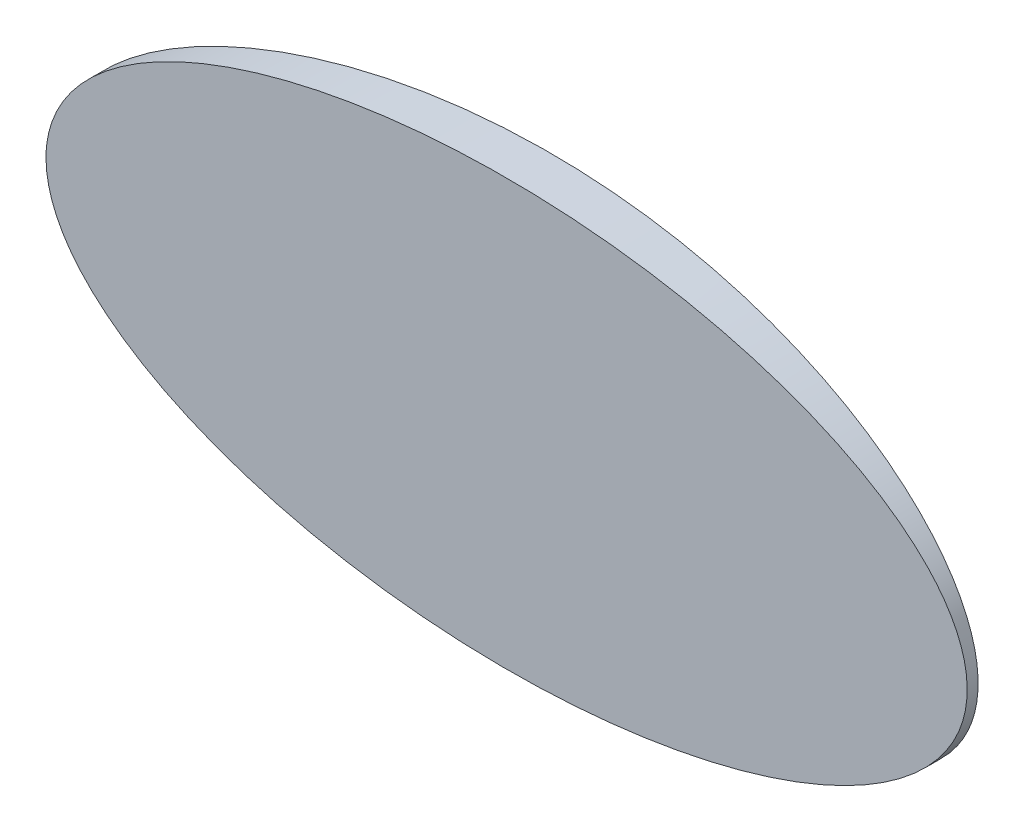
ISO-10303-21;
HEADER;
FILE_DESCRIPTION(('STEP AP214'),'2;1');
FILE_NAME('part.step','',(''),(''),'','','');
FILE_SCHEMA(('AUTOMOTIVE_DESIGN { 1 0 10303 214 1 1 1 1 }'));
ENDSEC;
DATA;
#1=APPLICATION_CONTEXT('core data for automotive mechanical design processes');
#2=APPLICATION_PROTOCOL_DEFINITION('international standard','automotive_design',2000,#1);
#3=PRODUCT_CONTEXT('',#1,'mechanical');
#4=PRODUCT('Part','Part','',(#3));
#5=PRODUCT_RELATED_PRODUCT_CATEGORY('part','',(#4));
#6=PRODUCT_DEFINITION_FORMATION('','',#4);
#7=PRODUCT_DEFINITION_CONTEXT('part definition',#1,'design');
#8=PRODUCT_DEFINITION('design','',#6,#7);
#9=PRODUCT_DEFINITION_SHAPE('','',#8);
#10=(LENGTH_UNIT() NAMED_UNIT(*) SI_UNIT(.MILLI.,.METRE.));
#11=(NAMED_UNIT(*) PLANE_ANGLE_UNIT() SI_UNIT($,.RADIAN.));
#12=(NAMED_UNIT(*) SI_UNIT($,.STERADIAN.) SOLID_ANGLE_UNIT());
#13=UNCERTAINTY_MEASURE_WITH_UNIT(LENGTH_MEASURE(1.E-05),#10,'distance_accuracy_value','');
#14=(GEOMETRIC_REPRESENTATION_CONTEXT(3) GLOBAL_UNCERTAINTY_ASSIGNED_CONTEXT((#13)) GLOBAL_UNIT_ASSIGNED_CONTEXT((#10,
#11,#12)) REPRESENTATION_CONTEXT('',''));
#15=CARTESIAN_POINT('',(0.,0.,0.));
#16=DIRECTION('',(0.,0.,1.));
#17=DIRECTION('',(1.,0.,0.));
#18=AXIS2_PLACEMENT_3D('',#15,#16,#17);
#19=CARTESIAN_POINT('',(0.,0.,0.));
#20=DIRECTION('',(0.,0.,1.));
#21=DIRECTION('',(1.,0.,0.));
#22=AXIS2_PLACEMENT_3D('',#19,#20,#21);
#23=PLANE('',#22);
#24=CARTESIAN_POINT('',(0.,0.,0.));
#25=DIRECTION('',(0.,0.,1.));
#26=DIRECTION('',(-1.,0.,0.));
#27=AXIS2_PLACEMENT_3D('',#24,#25,#26);
#28=ELLIPSE('',#27,80.7958192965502,37.3202862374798);
#29=CARTESIAN_POINT('',(-80.7958192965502,0.,0.));
#30=VERTEX_POINT('',#29);
#31=EDGE_CURVE('E45',#30,#30,#28,.T.);
#32=ORIENTED_EDGE('',*,*,#31,.T.);
#33=EDGE_LOOP('',(#32));
#34=FACE_BOUND('',#33,.T.);
#35=ADVANCED_FACE('F33',(#34),#23,.T.);
#36=CARTESIAN_POINT('',(0.,0.,-251.396320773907));
#37=DIRECTION('',(0.,0.,1.));
#38=DIRECTION('',(-1.,0.,0.));
#39=AXIS2_PLACEMENT_3D('',#36,#37,#38);
#40=ELLIPSE('',#39,80.7958192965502,37.3202862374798);
#41=DIRECTION('',(0.,0.,1.));
#42=VECTOR('',#41,1.);
#43=SURFACE_OF_LINEAR_EXTRUSION('',#40,#42);
#44=CARTESIAN_POINT('',(-80.7958192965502,0.,-1.91398695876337));
#45=CARTESIAN_POINT('',(-80.7958190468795,0.259526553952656,-1.91398699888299));
#46=CARTESIAN_POINT('',(-80.7899546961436,0.519061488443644,-1.9147975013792));
#47=CARTESIAN_POINT('',(-80.76653756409,1.03760978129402,-1.91803298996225));
#48=CARTESIAN_POINT('',(-80.7489837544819,1.29662309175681,-1.9204581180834));
#49=CARTESIAN_POINT('',(-80.7022883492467,1.81378879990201,-1.92690610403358));
#50=CARTESIAN_POINT('',(-80.673137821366,2.07194037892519,-1.93093019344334));
#51=CARTESIAN_POINT('',(-80.6034517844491,2.58668486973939,-1.94054333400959));
#52=CARTESIAN_POINT('',(-80.5629148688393,2.84327758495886,-1.94613257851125));
#53=CARTESIAN_POINT('',(-80.4241378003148,3.61253786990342,-1.96525076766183));
#54=CARTESIAN_POINT('',(-80.3089599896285,4.12218948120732,-1.98109848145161));
#55=CARTESIAN_POINT('',(-80.0364378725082,5.12995740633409,-2.01849483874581));
#56=CARTESIAN_POINT('',(-79.8790752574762,5.62806860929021,-2.04004595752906));
#57=CARTESIAN_POINT('',(-79.5254057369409,6.61093345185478,-2.08831797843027));
#58=CARTESIAN_POINT('',(-79.3290322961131,7.09566263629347,-2.11504771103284));
#59=CARTESIAN_POINT('',(-78.9013460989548,8.04905993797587,-2.17302939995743));
#60=CARTESIAN_POINT('',(-78.6700327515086,8.51772778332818,-2.20428143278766));
#61=CARTESIAN_POINT('',(-78.0597301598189,9.65515238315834,-2.28635803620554));
#62=CARTESIAN_POINT('',(-77.6625476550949,10.3140188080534,-2.33946164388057));
#63=CARTESIAN_POINT('',(-76.8119173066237,11.5937837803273,-2.45227305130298));
#64=CARTESIAN_POINT('',(-76.3584411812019,12.2146630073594,-2.51198416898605));
#65=CARTESIAN_POINT('',(-75.4040925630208,13.4201882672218,-2.63650811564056));
#66=CARTESIAN_POINT('',(-74.9031244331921,14.0047570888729,-2.70133119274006));
#67=CARTESIAN_POINT('',(-73.862755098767,15.1378734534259,-2.83460628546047));
#68=CARTESIAN_POINT('',(-73.3233563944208,15.6864233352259,-2.90305806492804));
#69=CARTESIAN_POINT('',(-72.1194914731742,16.8389042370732,-3.05417846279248));
#70=CARTESIAN_POINT('',(-71.4492212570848,17.4366952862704,-3.13730613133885));
#71=CARTESIAN_POINT('',(-70.073052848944,18.5901158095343,-3.30563126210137));
#72=CARTESIAN_POINT('',(-69.3671312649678,19.1457169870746,-3.39083006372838));
#73=CARTESIAN_POINT('',(-67.926211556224,20.2179936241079,-3.56216212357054));
#74=CARTESIAN_POINT('',(-67.1912046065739,20.7346571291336,-3.64829565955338));
#75=CARTESIAN_POINT('',(-65.6965863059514,21.7325418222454,-3.82067173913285));
#76=CARTESIAN_POINT('',(-64.9369519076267,22.213728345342,-3.90691430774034));
#77=CARTESIAN_POINT('',(-63.3979840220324,23.1427871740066,-4.07868396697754));
#78=CARTESIAN_POINT('',(-62.6186585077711,23.5906726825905,-4.16421132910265));
#79=CARTESIAN_POINT('',(-61.0432435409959,24.4558002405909,-4.3340011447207));
#80=CARTESIAN_POINT('',(-60.2471566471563,24.8730469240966,-4.41826378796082));
#81=CARTESIAN_POINT('',(-58.7732648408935,25.6126058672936,-4.57129556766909));
#82=CARTESIAN_POINT('',(-58.0976348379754,25.9392174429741,-4.6403255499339));
#83=CARTESIAN_POINT('',(-56.7376032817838,26.5737723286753,-4.77695314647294));
#84=CARTESIAN_POINT('',(-56.0532025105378,26.8817172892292,-4.84455088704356));
#85=CARTESIAN_POINT('',(-54.6776340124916,27.4795311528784,-4.97802088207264));
#86=CARTESIAN_POINT('',(-53.9864780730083,27.769426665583,-5.04389558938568));
#87=CARTESIAN_POINT('',(-52.5972312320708,28.3325484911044,-5.17385674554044));
#88=CARTESIAN_POINT('',(-51.8991400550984,28.6057741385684,-5.23794312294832));
#89=CARTESIAN_POINT('',(-49.7921318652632,29.4029897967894,-5.42760286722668));
#90=CARTESIAN_POINT('',(-48.3738449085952,29.9030675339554,-5.55024954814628));
#91=CARTESIAN_POINT('',(-45.5173057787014,30.8450466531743,-5.78674046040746));
#92=CARTESIAN_POINT('',(-44.0790509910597,31.2869403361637,-5.90058352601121));
#93=CARTESIAN_POINT('',(-41.1848687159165,32.1173540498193,-6.11879201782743));
#94=CARTESIAN_POINT('',(-39.7289239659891,32.5058164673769,-6.22314717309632));
#95=CARTESIAN_POINT('',(-36.8039381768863,33.2323646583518,-6.42160674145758));
#96=CARTESIAN_POINT('',(-35.3348976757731,33.5704524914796,-6.5157115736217));
#97=CARTESIAN_POINT('',(-32.3890810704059,34.1985181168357,-6.69298694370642));
#98=CARTESIAN_POINT('',(-30.9123268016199,34.4885924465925,-6.77617935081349));
#99=CARTESIAN_POINT('',(-27.9501222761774,35.0237759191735,-6.93144523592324));
#100=CARTESIAN_POINT('',(-26.4646719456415,35.2688846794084,-7.00351861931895));
#101=CARTESIAN_POINT('',(-23.4874040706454,35.7158891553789,-7.13618860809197));
#102=CARTESIAN_POINT('',(-21.9955893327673,35.9178022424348,-7.19678982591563));
#103=CARTESIAN_POINT('',(-19.006503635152,36.2799884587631,-7.3062890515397));
#104=CARTESIAN_POINT('',(-17.509232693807,36.4402617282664,-7.35518709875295));
#105=CARTESIAN_POINT('',(-14.5110702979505,36.7202298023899,-7.44106354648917));
#106=CARTESIAN_POINT('',(-13.0101802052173,36.8399380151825,-7.47804588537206));
#107=CARTESIAN_POINT('',(-10.0055182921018,37.0396512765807,-7.53996488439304));
#108=CARTESIAN_POINT('',(-8.5017464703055,37.1196563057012,-7.56490153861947));
#109=CARTESIAN_POINT('',(-5.49236995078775,37.2404924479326,-7.60263287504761));
#110=CARTESIAN_POINT('',(-3.98676512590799,37.2813206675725,-7.61542666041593));
#111=CARTESIAN_POINT('',(-0.974950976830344,37.3240574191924,-7.62881962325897));
#112=CARTESIAN_POINT('',(0.531258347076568,37.3259659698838,-7.62941880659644));
#113=CARTESIAN_POINT('',(3.54307812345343,37.2908769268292,-7.6184206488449));
#114=CARTESIAN_POINT('',(5.04868860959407,37.2538819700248,-7.60682413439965));
#115=CARTESIAN_POINT('',(8.0583006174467,37.1407505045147,-7.57148061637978));
#116=CARTESIAN_POINT('',(9.5623021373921,37.0646139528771,-7.54773359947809));
#117=CARTESIAN_POINT('',(12.5676170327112,36.8726957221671,-7.48818040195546));
#118=CARTESIAN_POINT('',(14.0689302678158,36.7569120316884,-7.45237360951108));
#119=CARTESIAN_POINT('',(17.0675633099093,36.4849267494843,-7.36884432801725));
#120=CARTESIAN_POINT('',(18.5648831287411,36.3287252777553,-7.32112187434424));
#121=CARTESIAN_POINT('',(21.5549942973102,35.9747359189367,-7.21392966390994));
#122=CARTESIAN_POINT('',(23.0477828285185,35.7769260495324,-7.15445369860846));
#123=CARTESIAN_POINT('',(26.0265724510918,35.3383522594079,-7.024025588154));
#124=CARTESIAN_POINT('',(27.512573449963,35.0975877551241,-6.95307328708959));
#125=CARTESIAN_POINT('',(30.4758492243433,34.57134312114,-6.80002811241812));
#126=CARTESIAN_POINT('',(31.953125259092,34.2858696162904,-6.71793688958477));
#127=CARTESIAN_POINT('',(34.8971597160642,33.6679344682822,-6.54300814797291));
#128=CARTESIAN_POINT('',(36.3639186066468,33.3354749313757,-6.45017111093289));
#129=CARTESIAN_POINT('',(38.8969052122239,32.7156163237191,-6.28025332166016));
#130=CARTESIAN_POINT('',(39.9661055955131,32.4396805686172,-6.20553126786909));
#131=CARTESIAN_POINT('',(42.0964323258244,31.8595894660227,-6.05079516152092));
#132=CARTESIAN_POINT('',(43.1575588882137,31.5554348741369,-5.97078125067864));
#133=CARTESIAN_POINT('',(45.2705137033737,30.9173165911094,-5.80573109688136));
#134=CARTESIAN_POINT('',(46.32234128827,30.5833507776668,-5.7206944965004));
#135=CARTESIAN_POINT('',(48.4150388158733,29.8837996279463,-5.54593178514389));
#136=CARTESIAN_POINT('',(49.4559090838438,29.5182152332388,-5.45620581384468));
#137=CARTESIAN_POINT('',(51.2978851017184,28.837163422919,-5.29260800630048));
#138=CARTESIAN_POINT('',(52.1015064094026,28.5282906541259,-5.21957523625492));
#139=CARTESIAN_POINT('',(53.6998063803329,27.8887761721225,-5.07111079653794));
#140=CARTESIAN_POINT('',(54.4944853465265,27.5581351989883,-4.99567920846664));
#141=CARTESIAN_POINT('',(56.0731084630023,26.8739603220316,-4.84272081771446));
#142=CARTESIAN_POINT('',(56.8570593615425,26.520441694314,-4.76519543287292));
#143=CARTESIAN_POINT('',(58.4132144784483,25.7887919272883,-4.6083010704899));
#144=CARTESIAN_POINT('',(59.1854190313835,25.4106614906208,-4.52893214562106));
#145=CARTESIAN_POINT('',(60.5272316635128,24.724660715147,-4.38848708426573));
#146=CARTESIAN_POINT('',(61.0997912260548,24.4224914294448,-4.32773232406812));
#147=CARTESIAN_POINT('',(62.2362179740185,23.8023767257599,-4.20555939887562));
#148=CARTESIAN_POINT('',(62.800085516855,23.4844319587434,-4.14414126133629));
#149=CARTESIAN_POINT('',(63.9189644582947,22.8313010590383,-4.02074210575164));
#150=CARTESIAN_POINT('',(64.4739596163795,22.4960872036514,-3.95876032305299));
#151=CARTESIAN_POINT('',(65.5728697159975,21.8078613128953,-3.83456815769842));
#152=CARTESIAN_POINT('',(66.1167835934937,21.4548475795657,-3.77235775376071));
#153=CARTESIAN_POINT('',(67.2252147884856,20.7074997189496,-3.64414220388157));
#154=CARTESIAN_POINT('',(67.7889224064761,20.3119605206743,-3.57814061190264));
#155=CARTESIAN_POINT('',(68.8998675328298,19.4981121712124,-3.44658775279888));
#156=CARTESIAN_POINT('',(69.4471028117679,19.0797999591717,-3.38103654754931));
#157=CARTESIAN_POINT('',(70.5225068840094,18.2187600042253,-3.25084346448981));
#158=CARTESIAN_POINT('',(71.0506690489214,17.7760239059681,-3.18620190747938));
#159=CARTESIAN_POINT('',(72.0835504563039,16.8654385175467,-3.05852923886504));
#160=CARTESIAN_POINT('',(72.5883077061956,16.3976328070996,-2.99549559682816));
#161=CARTESIAN_POINT('',(73.5712489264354,15.4346813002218,-2.87161747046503));
#162=CARTESIAN_POINT('',(74.0494398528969,14.9395427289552,-2.81077241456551));
#163=CARTESIAN_POINT('',(74.9741000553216,13.9208478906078,-2.69213149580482));
#164=CARTESIAN_POINT('',(75.4205885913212,13.3973092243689,-2.63433378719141));
#165=CARTESIAN_POINT('',(76.5904110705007,11.9249674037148,-2.48175222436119));
#166=CARTESIAN_POINT('',(77.2771044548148,10.9454424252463,-2.39087049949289));
#167=CARTESIAN_POINT('',(78.1943410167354,9.40901855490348,-2.2682883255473));
#168=CARTESIAN_POINT('',(78.4812199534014,8.88584723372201,-2.22972674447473));
#169=CARTESIAN_POINT('',(79.0121711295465,7.81768745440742,-2.15805148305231));
#170=CARTESIAN_POINT('',(79.2562499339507,7.27270235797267,-2.12493696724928));
#171=CARTESIAN_POINT('',(79.6628687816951,6.24635227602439,-2.06958194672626));
#172=CARTESIAN_POINT('',(79.8321475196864,5.76770228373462,-2.04645545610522));
#173=CARTESIAN_POINT('',(80.1322646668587,4.79824432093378,-2.00536152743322));
#174=CARTESIAN_POINT('',(80.2631066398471,4.30743748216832,-1.9873936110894));
#175=CARTESIAN_POINT('',(80.4833299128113,3.31672511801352,-1.95710492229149));
#176=CARTESIAN_POINT('',(80.5727382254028,2.81682574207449,-1.94478047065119));
#177=CARTESIAN_POINT('',(80.7080048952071,1.81101840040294,-1.92612007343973));
#178=CARTESIAN_POINT('',(80.7538630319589,1.30511040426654,-1.91978415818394));
#179=CARTESIAN_POINT('',(80.8008859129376,0.289696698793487,-1.91328720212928));
#180=CARTESIAN_POINT('',(80.80192066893,-0.21981518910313,-1.91314412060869));
#181=CARTESIAN_POINT('',(80.7589416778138,-1.23687656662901,-1.91908255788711));
#182=CARTESIAN_POINT('',(80.7149286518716,-1.74442608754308,-1.92516397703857));
#183=CARTESIAN_POINT('',(80.5829887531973,-2.75389772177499,-1.94336720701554));
#184=CARTESIAN_POINT('',(80.4950403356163,-3.25581695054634,-1.95549198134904));
#185=CARTESIAN_POINT('',(80.2774242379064,-4.25033755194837,-1.98542648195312));
#186=CARTESIAN_POINT('',(80.1477518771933,-4.7429378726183,-2.00323684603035));
#187=CARTESIAN_POINT('',(79.8202326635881,-5.8119052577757,-2.04809132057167));
#188=CARTESIAN_POINT('',(79.6139875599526,-6.38565491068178,-2.07626331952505));
#189=CARTESIAN_POINT('',(79.1517529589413,-7.51232532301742,-2.13912223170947));
#190=CARTESIAN_POINT('',(78.8957532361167,-8.06524177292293,-2.17381048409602));
#191=CARTESIAN_POINT('',(78.3396760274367,-9.14900563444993,-2.24876475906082));
#192=CARTESIAN_POINT('',(78.039530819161,-9.67981750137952,-2.28903934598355));
#193=CARTESIAN_POINT('',(77.401260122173,-10.7176103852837,-2.37417278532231));
#194=CARTESIAN_POINT('',(77.0631323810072,-11.2245899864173,-2.41903190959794));
#195=CARTESIAN_POINT('',(76.3438002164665,-12.2291444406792,-2.51383072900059));
#196=CARTESIAN_POINT('',(75.9616253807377,-12.7260109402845,-2.56388062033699));
#197=CARTESIAN_POINT('',(75.1674425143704,-13.6952535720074,-2.66710741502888));
#198=CARTESIAN_POINT('',(74.7554198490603,-14.1676174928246,-2.7202858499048));
#199=CARTESIAN_POINT('',(73.9058925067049,-15.0886405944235,-2.82904269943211));
#200=CARTESIAN_POINT('',(73.4683827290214,-15.5372949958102,-2.88462159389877));
#201=CARTESIAN_POINT('',(72.5708462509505,-16.4126323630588,-2.99765029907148));
#202=CARTESIAN_POINT('',(72.110784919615,-16.8392793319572,-3.05510293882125));
#203=CARTESIAN_POINT('',(71.1719440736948,-17.6709442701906,-3.17126246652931));
#204=CARTESIAN_POINT('',(70.6931697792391,-18.0759681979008,-3.22996900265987));
#205=CARTESIAN_POINT('',(69.7193479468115,-18.8656998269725,-3.3482116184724));
#206=CARTESIAN_POINT('',(69.2243013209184,-19.2504086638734,-3.4077476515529));
#207=CARTESIAN_POINT('',(68.0191543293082,-20.1507979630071,-3.55119156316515));
#208=CARTESIAN_POINT('',(67.3022318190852,-20.6573215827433,-3.63532345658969));
#209=CARTESIAN_POINT('',(65.8453696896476,-21.63589093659,-3.8036523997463));
#210=CARTESIAN_POINT('',(65.1054301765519,-22.1079368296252,-3.88784944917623));
#211=CARTESIAN_POINT('',(63.6072384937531,-23.0196300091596,-4.05553026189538));
#212=CARTESIAN_POINT('',(62.8490129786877,-23.4593210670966,-4.13901484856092));
#213=CARTESIAN_POINT('',(61.316228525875,-24.3093803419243,-4.30484597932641));
#214=CARTESIAN_POINT('',(60.5416696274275,-24.7197486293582,-4.38719252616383));
#215=CARTESIAN_POINT('',(58.9803772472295,-25.5123381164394,-4.55011725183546));
#216=CARTESIAN_POINT('',(58.1936756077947,-25.8946214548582,-4.63069903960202));
#217=CARTESIAN_POINT('',(56.6083139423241,-26.6338767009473,-4.78991932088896));
#218=CARTESIAN_POINT('',(55.8096540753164,-26.9908489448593,-4.86855784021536));
#219=CARTESIAN_POINT('',(54.2016907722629,-27.6811874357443,-5.02360924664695));
#220=CARTESIAN_POINT('',(53.3923839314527,-28.0145459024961,-5.10002139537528));
#221=CARTESIAN_POINT('',(51.7646660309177,-28.6589372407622,-5.25033459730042));
#222=CARTESIAN_POINT('',(50.9462544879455,-28.9699689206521,-5.32423551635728));
#223=CARTESIAN_POINT('',(49.325308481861,-29.5622066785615,-5.46719571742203));
#224=CARTESIAN_POINT('',(48.5230009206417,-29.8440157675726,-5.53633323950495));
#225=CARTESIAN_POINT('',(46.9117436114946,-30.3887052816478,-5.67184843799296));
#226=CARTESIAN_POINT('',(46.1027936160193,-30.6515849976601,-5.73822601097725));
#227=CARTESIAN_POINT('',(43.6669446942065,-31.4132203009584,-5.93299395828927));
#228=CARTESIAN_POINT('',(42.0311718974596,-31.8849267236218,-6.05700850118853));
#229=CARTESIAN_POINT('',(38.7403339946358,-32.76218786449,-6.29237207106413));
#230=CARTESIAN_POINT('',(37.0852593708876,-33.1677083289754,-6.40371453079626));
#231=CARTESIAN_POINT('',(33.7604430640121,-33.9168583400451,-6.61286164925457));
#232=CARTESIAN_POINT('',(32.0907021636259,-34.2604911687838,-6.71066702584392));
#233=CARTESIAN_POINT('',(28.743149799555,-34.8887892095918,-6.89191792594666));
#234=CARTESIAN_POINT('',(27.0653632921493,-35.1735791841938,-6.97539376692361));
#235=CARTESIAN_POINT('',(23.7006882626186,-35.6878803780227,-7.12774876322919));
#236=CARTESIAN_POINT('',(22.0137996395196,-35.9173909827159,-7.19662775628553));
#237=CARTESIAN_POINT('',(18.633624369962,-36.3231763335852,-7.3193878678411));
#238=CARTESIAN_POINT('',(16.940339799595,-36.4994670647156,-7.37327348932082));
#239=CARTESIAN_POINT('',(13.5487975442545,-36.8004555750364,-7.46579026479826));
#240=CARTESIAN_POINT('',(11.8505398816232,-36.9251535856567,-7.50442148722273));
#241=CARTESIAN_POINT('',(8.451438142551,-37.1239826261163,-7.56622156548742));
#242=CARTESIAN_POINT('',(6.75059528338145,-37.1981327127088,-7.58939624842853));
#243=CARTESIAN_POINT('',(3.34732787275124,-37.2965597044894,-7.62019135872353));
#244=CARTESIAN_POINT('',(1.64490331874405,-37.3208365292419,-7.6278117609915));
#245=CARTESIAN_POINT('',(-1.76014340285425,-37.31971696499,-7.62746072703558));
#246=CARTESIAN_POINT('',(-3.46276556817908,-37.2943142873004,-7.6194873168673));
#247=CARTESIAN_POINT('',(-6.86638835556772,-37.1936137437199,-7.5879840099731));
#248=CARTESIAN_POINT('',(-8.56738898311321,-37.1183160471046,-7.56445416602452));
#249=CARTESIAN_POINT('',(-11.9666226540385,-36.9171681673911,-7.50194601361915));
#250=CARTESIAN_POINT('',(-13.6648547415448,-36.7913031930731,-7.46296318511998));
#251=CARTESIAN_POINT('',(-17.0563208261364,-36.4879454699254,-7.36974687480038));
#252=CARTESIAN_POINT('',(-18.7495547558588,-36.3104520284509,-7.31551318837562));
#253=CARTESIAN_POINT('',(-22.1287732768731,-35.9023110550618,-7.19209277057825));
#254=CARTESIAN_POINT('',(-23.8147590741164,-35.6716727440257,-7.12290863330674));
#255=CARTESIAN_POINT('',(-27.1775531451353,-35.1551165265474,-6.96996604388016));
#256=CARTESIAN_POINT('',(-28.8543618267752,-34.8692010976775,-6.88620824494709));
#257=CARTESIAN_POINT('',(-31.7666514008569,-34.3202808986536,-6.7279623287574));
#258=CARTESIAN_POINT('',(-33.0047664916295,-34.0702829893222,-6.65662687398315));
#259=CARTESIAN_POINT('',(-35.4732999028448,-33.5368141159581,-6.50644136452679));
#260=CARTESIAN_POINT('',(-36.70371842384,-33.2533440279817,-6.42759150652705));
#261=CARTESIAN_POINT('',(-39.1555241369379,-32.6512137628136,-6.26267046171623));
#262=CARTESIAN_POINT('',(-40.3769107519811,-32.3325513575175,-6.17659881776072));
#263=CARTESIAN_POINT('',(-42.8088627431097,-31.6580249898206,-5.9975972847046));
#264=CARTESIAN_POINT('',(-44.0194284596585,-31.3021622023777,-5.90466761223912));
#265=CARTESIAN_POINT('',(-46.1488743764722,-30.6377843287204,-5.73464386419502));
#266=CARTESIAN_POINT('',(-47.070395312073,-30.3373830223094,-5.65886491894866));
#267=CARTESIAN_POINT('',(-48.9047002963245,-29.7118735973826,-5.5037461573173));
#268=CARTESIAN_POINT('',(-49.817484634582,-29.3867663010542,-5.42440645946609));
#269=CARTESIAN_POINT('',(-51.6323858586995,-28.7105827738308,-5.26249102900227));
#270=CARTESIAN_POINT('',(-52.5345096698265,-28.3595246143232,-5.17991756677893));
#271=CARTESIAN_POINT('',(-54.3271366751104,-27.6295296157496,-5.01180189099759));
#272=CARTESIAN_POINT('',(-55.2176401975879,-27.2505935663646,-4.92625976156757));
#273=CARTESIAN_POINT('',(-56.7632895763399,-26.5617108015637,-4.77438200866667));
#274=CARTESIAN_POINT('',(-57.4214153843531,-26.2583166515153,-4.70861391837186));
#275=CARTESIAN_POINT('',(-58.7290735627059,-25.6338269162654,-4.57581525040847));
#276=CARTESIAN_POINT('',(-59.3786062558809,-25.3127319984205,-4.50878472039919));
#277=CARTESIAN_POINT('',(-60.669087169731,-24.6511987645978,-4.37355734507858));
#278=CARTESIAN_POINT('',(-61.3100183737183,-24.3107275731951,-4.30535866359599));
#279=CARTESIAN_POINT('',(-62.5808262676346,-23.6097412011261,-4.16815798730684));
#280=CARTESIAN_POINT('',(-63.2107020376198,-23.2492243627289,-4.09915592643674));
#281=CARTESIAN_POINT('',(-64.4932543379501,-22.485703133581,-3.95670576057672));
#282=CARTESIAN_POINT('',(-65.1451854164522,-22.0814483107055,-3.88322832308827));
#283=CARTESIAN_POINT('',(-66.4325973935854,-21.2473163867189,-3.73612423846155));
#284=CARTESIAN_POINT('',(-67.0680760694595,-20.8174358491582,-3.66249757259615));
#285=CARTESIAN_POINT('',(-68.3198835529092,-19.9300220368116,-3.51558378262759));
#286=CARTESIAN_POINT('',(-68.9362051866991,-19.4724785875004,-3.44229679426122));
#287=CARTESIAN_POINT('',(-70.1445848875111,-18.5288528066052,-3.29686932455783));
#288=CARTESIAN_POINT('',(-70.7366942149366,-18.0428367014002,-3.22472664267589));
#289=CARTESIAN_POINT('',(-71.8936049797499,-17.0392846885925,-3.08219105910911));
#290=CARTESIAN_POINT('',(-72.4584141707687,-16.5217578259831,-3.01179766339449));
#291=CARTESIAN_POINT('',(-73.5551710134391,-15.4531664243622,-2.87370332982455));
#292=CARTESIAN_POINT('',(-74.0871402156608,-14.9021243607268,-2.80600063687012));
#293=CARTESIAN_POINT('',(-75.0093035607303,-13.8780814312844,-2.68755115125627));
#294=CARTESIAN_POINT('',(-75.4065605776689,-13.411540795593,-2.63612319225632));
#295=CARTESIAN_POINT('',(-75.9804488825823,-12.6940052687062,-2.56132609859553));
#296=CARTESIAN_POINT('',(-76.1680702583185,-12.4518847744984,-2.53678566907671));
#297=CARTESIAN_POINT('',(-76.535473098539,-11.9615726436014,-2.48857369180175));
#298=CARTESIAN_POINT('',(-76.7152522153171,-11.7133792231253,-2.46490240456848));
#299=CARTESIAN_POINT('',(-77.2420599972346,-10.9593772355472,-2.39532427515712));
#300=CARTESIAN_POINT('',(-77.5763455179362,-10.4444121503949,-2.35088104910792));
#301=CARTESIAN_POINT('',(-78.2052515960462,-9.39052566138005,-2.26682818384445));
#302=CARTESIAN_POINT('',(-78.4998861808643,-8.85161281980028,-2.22721683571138));
#303=CARTESIAN_POINT('',(-78.9556778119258,-7.92882805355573,-2.16567024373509));
#304=CARTESIAN_POINT('',(-79.1291971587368,-7.55114292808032,-2.14215990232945));
#305=CARTESIAN_POINT('',(-79.4534662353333,-6.78586801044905,-2.09810912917));
#306=CARTESIAN_POINT('',(-79.6042142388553,-6.39827746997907,-2.07756892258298));
#307=CARTESIAN_POINT('',(-79.8810450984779,-5.61409778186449,-2.03976710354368));
#308=CARTESIAN_POINT('',(-80.0071219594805,-5.21750647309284,-2.02250628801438));
#309=CARTESIAN_POINT('',(-80.2323480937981,-4.41824316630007,-1.99161847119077));
#310=CARTESIAN_POINT('',(-80.3315999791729,-4.01560074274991,-1.97797762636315));
#311=CARTESIAN_POINT('',(-80.5022695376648,-3.20443275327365,-1.954492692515));
#312=CARTESIAN_POINT('',(-80.5736934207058,-2.79590852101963,-1.94464775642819));
#313=CARTESIAN_POINT('',(-80.6874892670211,-1.97515426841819,-1.92895106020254));
#314=CARTESIAN_POINT('',(-80.7298930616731,-1.56292881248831,-1.92309492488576));
#315=CARTESIAN_POINT('',(-80.7702379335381,-0.958409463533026,-1.91752176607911));
#316=CARTESIAN_POINT('',(-80.7798277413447,-0.766845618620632,-1.91619674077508));
#317=CARTESIAN_POINT('',(-80.7926180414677,-0.383522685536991,-1.91442938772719));
#318=CARTESIAN_POINT('',(-80.7958194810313,-0.191763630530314,-1.91398692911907));
#319=CARTESIAN_POINT('',(-80.7958192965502,0.,-1.91398695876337));
#320=B_SPLINE_CURVE_WITH_KNOTS('',3,(#44,#45,#46,#47,#48,#49,#50,#51,#52,#53,#54,#55,#56,#57,
#58,#59,#60,#61,#62,#63,#64,#65,#66,#67,#68,#69,#70,#71,#72,#73,#74,#75,#76,#77,#78,#79,#80,#81,
#82,#83,#84,#85,#86,#87,#88,#89,#90,#91,#92,#93,#94,#95,#96,#97,#98,#99,#100,#101,#102,#103,
#104,#105,#106,#107,#108,#109,#110,#111,#112,#113,#114,#115,#116,#117,#118,#119,#120,#121,#122,
#123,#124,#125,#126,#127,#128,#129,#130,#131,#132,#133,#134,#135,#136,#137,#138,#139,#140,#141,
#142,#143,#144,#145,#146,#147,#148,#149,#150,#151,#152,#153,#154,#155,#156,#157,#158,#159,#160,
#161,#162,#163,#164,#165,#166,#167,#168,#169,#170,#171,#172,#173,#174,#175,#176,#177,#178,#179,
#180,#181,#182,#183,#184,#185,#186,#187,#188,#189,#190,#191,#192,#193,#194,#195,#196,#197,#198,
#199,#200,#201,#202,#203,#204,#205,#206,#207,#208,#209,#210,#211,#212,#213,#214,#215,#216,#217,
#218,#219,#220,#221,#222,#223,#224,#225,#226,#227,#228,#229,#230,#231,#232,#233,#234,#235,#236,
#237,#238,#239,#240,#241,#242,#243,#244,#245,#246,#247,#248,#249,#250,#251,#252,#253,#254,#255,
#256,#257,#258,#259,#260,#261,#262,#263,#264,#265,#266,#267,#268,#269,#270,#271,#272,#273,#274,
#275,#276,#277,#278,#279,#280,#281,#282,#283,#284,#285,#286,#287,#288,#289,#290,#291,#292,#293,
#294,#295,#296,#297,#298,#299,#300,#301,#302,#303,#304,#305,#306,#307,#308,#309,#310,#311,#312,
#313,#314,#315,#316,#317,#318,#319),.UNSPECIFIED.,.T.,.F.,(4,2,2,2,2,2,2,2,2,2,2,2,2,2,2,2,2,2,
2,2,2,2,2,2,2,2,2,2,2,2,2,2,2,2,2,2,2,2,2,2,2,2,2,2,2,2,2,2,2,2,2,2,2,2,2,2,2,2,2,2,2,2,2,2,2,2,
2,2,2,2,2,2,2,2,2,2,2,2,2,2,2,2,2,2,2,2,2,2,2,2,2,2,2,2,2,2,2,2,2,2,2,2,2,2,2,2,2,2,2,2,2,2,2,2,
2,2,2,2,2,2,2,2,2,2,2,2,2,2,2,2,2,2,2,2,2,2,2,4),(0.,0.778526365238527,1.55712122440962,
2.33631695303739,3.11560897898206,4.6816926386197,6.24845709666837,7.81791707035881,
9.38740359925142,11.6971731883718,14.0081079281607,16.3237993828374,18.6393403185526,
21.3432039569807,24.0488653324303,26.755354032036,29.4644531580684,32.1724724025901,
34.8800812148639,37.14059790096,39.4009144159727,41.6578156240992,43.9148068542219,
48.439815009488,52.9654213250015,57.4958698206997,62.0261330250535,66.5471738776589,
71.0682531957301,75.5875109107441,80.1067534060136,84.6245006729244,89.142250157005,
93.6603332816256,98.178414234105,102.69618896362,107.213968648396,111.73197756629,
116.249973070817,120.770361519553,125.290811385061,129.810592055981,134.330170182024,
137.650085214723,140.96991137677,144.289974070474,147.609937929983,150.201730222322,
152.793434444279,155.383425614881,157.973342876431,159.923863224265,161.874303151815,
163.827978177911,165.781839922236,167.85668694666,169.931813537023,172.007654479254,
174.079997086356,176.151794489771,178.222322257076,181.808762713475,183.600957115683,
185.392876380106,186.916082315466,188.43914697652,189.961217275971,191.483295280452,
193.009787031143,194.53625434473,196.063470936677,197.590858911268,199.41917186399,
201.247860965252,203.079385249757,204.911018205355,206.796203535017,208.682319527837,
210.568814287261,212.458302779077,214.347267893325,216.236127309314,218.880445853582,
221.524752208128,224.165412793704,226.806067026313,229.440690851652,232.075279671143,
234.710732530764,237.34632594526,239.905566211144,242.464902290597,247.583974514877,
252.70568770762,257.827129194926,262.937597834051,268.048123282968,273.157112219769,
278.266078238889,283.373117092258,288.480164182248,293.587857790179,298.695534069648,
303.804705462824,308.91394540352,314.022299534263,319.130424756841,322.925330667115,
326.720137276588,330.515184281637,334.310111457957,337.226406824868,340.142605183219,
343.056791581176,345.970895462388,348.153666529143,350.336355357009,352.522864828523,
354.70955538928,357.020826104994,359.332407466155,361.644844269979,363.952100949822,
366.258698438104,368.563765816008,370.407386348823,371.329107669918,372.251103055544,
374.096116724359,375.940475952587,377.188717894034,378.437054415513,379.68569390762,
380.929487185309,382.173002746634,383.415152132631,383.990488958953,384.565740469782),.UNSPECIFIED.);
#321=CARTESIAN_POINT('',(-80.7958192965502,0.,-1.91398695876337));
#322=VERTEX_POINT('',#321);
#323=EDGE_CURVE('E10',#322,#322,#320,.T.);
#324=ORIENTED_EDGE('',*,*,#323,.F.);
#325=EDGE_LOOP('',(#324));
#326=FACE_BOUND('',#325,.T.);
#327=ORIENTED_EDGE('',*,*,#31,.F.);
#328=EDGE_LOOP('',(#327));
#329=FACE_BOUND('',#328,.T.);
#330=ADVANCED_FACE('F35',(#326,#329),#43,.T.);
#331=CARTESIAN_POINT('',(-97.5,0.,-126.654653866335));
#332=DIRECTION('',(1.,0.,0.));
#333=DIRECTION('',(0.,0.,-1.));
#334=AXIS2_PLACEMENT_3D('',#331,#332,#333);
#335=CYLINDRICAL_SURFACE('',#334,124.740666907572);
#336=ORIENTED_EDGE('',*,*,#323,.T.);
#337=EDGE_LOOP('',(#336));
#338=FACE_BOUND('',#337,.T.);
#339=ADVANCED_FACE('F54',(#338),#335,.F.);
#340=CLOSED_SHELL('',(#35,#330,#339));
#341=MANIFOLD_SOLID_BREP('B2',#340);
#342=ADVANCED_BREP_SHAPE_REPRESENTATION('',(#18,#341),#14);
#343=SHAPE_DEFINITION_REPRESENTATION(#9,#342);
ENDSEC;
END-ISO-10303-21;
